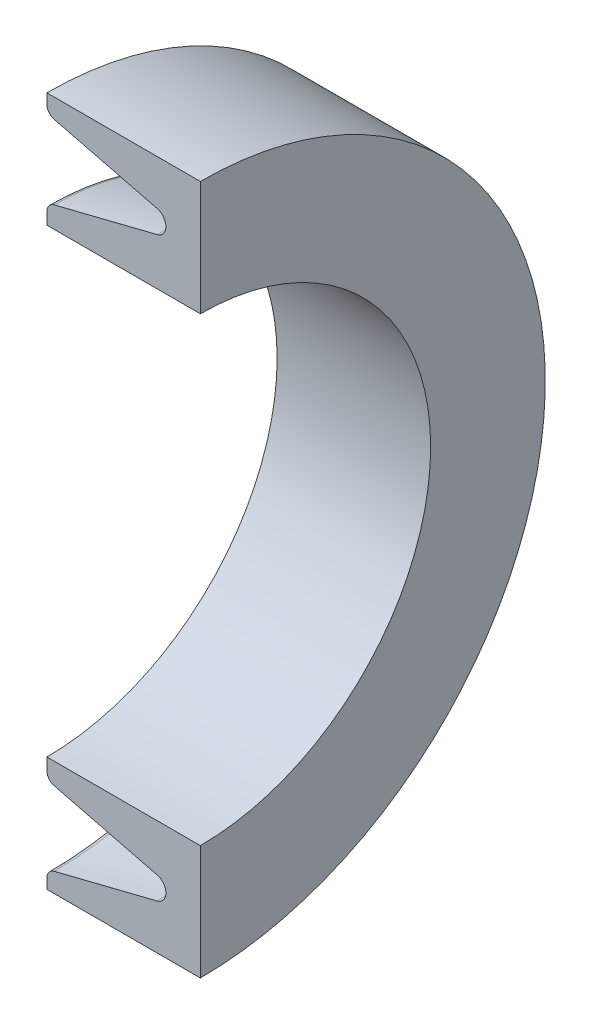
ISO-10303-21;
HEADER;
FILE_DESCRIPTION(('STEP AP214'),'2;1');
FILE_NAME('part.step','',(''),(''),'','','');
FILE_SCHEMA(('AUTOMOTIVE_DESIGN { 1 0 10303 214 1 1 1 1 }'));
ENDSEC;
DATA;
#1=APPLICATION_CONTEXT('core data for automotive mechanical design processes');
#2=APPLICATION_PROTOCOL_DEFINITION('international standard','automotive_design',2000,#1);
#3=PRODUCT_CONTEXT('',#1,'mechanical');
#4=PRODUCT('Part','Part','',(#3));
#5=PRODUCT_RELATED_PRODUCT_CATEGORY('part','',(#4));
#6=PRODUCT_DEFINITION_FORMATION('','',#4);
#7=PRODUCT_DEFINITION_CONTEXT('part definition',#1,'design');
#8=PRODUCT_DEFINITION('design','',#6,#7);
#9=PRODUCT_DEFINITION_SHAPE('','',#8);
#10=(LENGTH_UNIT() NAMED_UNIT(*) SI_UNIT(.MILLI.,.METRE.));
#11=(NAMED_UNIT(*) PLANE_ANGLE_UNIT() SI_UNIT($,.RADIAN.));
#12=(NAMED_UNIT(*) SI_UNIT($,.STERADIAN.) SOLID_ANGLE_UNIT());
#13=UNCERTAINTY_MEASURE_WITH_UNIT(LENGTH_MEASURE(1.E-05),#10,'distance_accuracy_value','');
#14=(GEOMETRIC_REPRESENTATION_CONTEXT(3) GLOBAL_UNCERTAINTY_ASSIGNED_CONTEXT((#13)) GLOBAL_UNIT_ASSIGNED_CONTEXT((#10,
#11,#12)) REPRESENTATION_CONTEXT('',''));
#15=CARTESIAN_POINT('',(0.,0.,0.));
#16=DIRECTION('',(0.,0.,1.));
#17=DIRECTION('',(1.,0.,0.));
#18=AXIS2_PLACEMENT_3D('',#15,#16,#17);
#19=CARTESIAN_POINT('',(-20.,40.,0.));
#20=DIRECTION('',(-1.,0.,0.));
#21=DIRECTION('',(0.,0.,1.));
#22=AXIS2_PLACEMENT_3D('',#19,#20,#21);
#23=PLANE('',#22);
#24=DIRECTION('',(0.,-1.,0.));
#25=VECTOR('',#24,1.);
#26=CARTESIAN_POINT('',(-20.,40.,0.));
#27=LINE('',#26,#25);
#28=CARTESIAN_POINT('',(-20.,64.3096117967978,0.));
#29=VERTEX_POINT('',#28);
#30=CARTESIAN_POINT('',(-20.,63.7,0.));
#31=VERTEX_POINT('',#30);
#32=EDGE_CURVE('E176',#29,#31,#27,.T.);
#33=ORIENTED_EDGE('',*,*,#32,.F.);
#34=CARTESIAN_POINT('',(-20.,51.85,0.));
#35=DIRECTION('',(-1.,0.,0.));
#36=DIRECTION('',(0.,0.,1.));
#37=AXIS2_PLACEMENT_3D('',#34,#35,#36);
#38=CIRCLE('',#37,12.4596117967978);
#39=CARTESIAN_POINT('',(-20.,39.3903882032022,0.));
#40=VERTEX_POINT('',#39);
#41=EDGE_CURVE('E138',#29,#40,#38,.T.);
#42=ORIENTED_EDGE('',*,*,#41,.T.);
#43=CARTESIAN_POINT('',(-20.,40.,0.));
#44=VERTEX_POINT('',#43);
#45=EDGE_CURVE('E46',#44,#40,#27,.T.);
#46=ORIENTED_EDGE('',*,*,#45,.F.);
#47=CARTESIAN_POINT('',(-20.,51.85,0.));
#48=DIRECTION('',(-1.,0.,0.));
#49=DIRECTION('',(0.,0.,1.));
#50=AXIS2_PLACEMENT_3D('',#47,#48,#49);
#51=CIRCLE('',#50,11.85);
#52=EDGE_CURVE('E124',#31,#44,#51,.T.);
#53=ORIENTED_EDGE('',*,*,#52,.F.);
#54=EDGE_LOOP('',(#33,#42,#46,#53));
#55=FACE_BOUND('',#54,.T.);
#56=ADVANCED_FACE('F24',(#55),#23,.T.);
#57=CARTESIAN_POINT('',(-28.0999999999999,51.85,0.));
#58=DIRECTION('',(-1.,0.,0.));
#59=DIRECTION('',(0.,0.,1.));
#60=AXIS2_PLACEMENT_3D('',#57,#58,#59);
#61=CYLINDRICAL_SURFACE('',#60,11.85);
#62=ORIENTED_EDGE('',*,*,#52,.T.);
#63=DIRECTION('',(-1.,0.,0.));
#64=VECTOR('',#63,1.);
#65=CARTESIAN_POINT('',(-28.0999999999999,40.,0.));
#66=LINE('',#65,#64);
#67=CARTESIAN_POINT('',(-12.1,40.,0.));
#68=VERTEX_POINT('',#67);
#69=EDGE_CURVE('E150',#44,#68,#66,.F.);
#70=ORIENTED_EDGE('',*,*,#69,.T.);
#71=CARTESIAN_POINT('',(-12.1,51.85,0.));
#72=DIRECTION('',(-1.,0.,0.));
#73=DIRECTION('',(0.,0.,1.));
#74=AXIS2_PLACEMENT_3D('',#71,#72,#73);
#75=CIRCLE('',#74,11.85);
#76=CARTESIAN_POINT('',(-12.1,63.7,0.));
#77=VERTEX_POINT('',#76);
#78=EDGE_CURVE('E116',#77,#68,#75,.T.);
#79=ORIENTED_EDGE('',*,*,#78,.F.);
#80=DIRECTION('',(-1.,0.,0.));
#81=VECTOR('',#80,1.);
#82=CARTESIAN_POINT('',(-28.0999999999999,63.7,0.));
#83=LINE('',#82,#81);
#84=EDGE_CURVE('E185',#77,#31,#83,.T.);
#85=ORIENTED_EDGE('',*,*,#84,.T.);
#86=EDGE_LOOP('',(#62,#70,#79,#85));
#87=FACE_BOUND('',#86,.T.);
#88=ADVANCED_FACE('F187',(#87),#61,.F.);
#89=CARTESIAN_POINT('',(-12.1,40.,0.));
#90=DIRECTION('',(-1.,0.,0.));
#91=DIRECTION('',(0.,0.,1.));
#92=AXIS2_PLACEMENT_3D('',#89,#90,#91);
#93=PLANE('',#92);
#94=CARTESIAN_POINT('',(-12.1,51.85,0.));
#95=DIRECTION('',(-1.,0.,0.));
#96=DIRECTION('',(0.,0.,1.));
#97=AXIS2_PLACEMENT_3D('',#94,#95,#96);
#98=CIRCLE('',#97,17.75);
#99=CARTESIAN_POINT('',(-12.1,69.6,0.));
#100=VERTEX_POINT('',#99);
#101=CARTESIAN_POINT('',(-12.1,34.1,0.));
#102=VERTEX_POINT('',#101);
#103=EDGE_CURVE('E114',#100,#102,#98,.T.);
#104=ORIENTED_EDGE('',*,*,#103,.F.);
#105=DIRECTION('',(0.,1.,0.));
#106=VECTOR('',#105,1.);
#107=CARTESIAN_POINT('',(-12.1,33.,0.));
#108=LINE('',#107,#106);
#109=EDGE_CURVE('E117',#77,#100,#108,.T.);
#110=ORIENTED_EDGE('',*,*,#109,.F.);
#111=ORIENTED_EDGE('',*,*,#78,.T.);
#112=EDGE_CURVE('E100',#102,#68,#108,.T.);
#113=ORIENTED_EDGE('',*,*,#112,.F.);
#114=EDGE_LOOP('',(#104,#110,#111,#113));
#115=FACE_BOUND('',#114,.T.);
#116=ADVANCED_FACE('F112',(#115),#93,.F.);
#117=CARTESIAN_POINT('',(-28.0999999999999,51.85,0.));
#118=DIRECTION('',(-1.,0.,0.));
#119=DIRECTION('',(0.,0.,1.));
#120=AXIS2_PLACEMENT_3D('',#117,#118,#119);
#121=CYLINDRICAL_SURFACE('',#120,17.75);
#122=DIRECTION('',(-1.,0.,0.));
#123=VECTOR('',#122,1.);
#124=CARTESIAN_POINT('',(-28.0999999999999,34.1,0.));
#125=LINE('',#124,#123);
#126=CARTESIAN_POINT('',(-20.,34.1,0.));
#127=VERTEX_POINT('',#126);
#128=EDGE_CURVE('E97',#127,#102,#125,.F.);
#129=ORIENTED_EDGE('',*,*,#128,.F.);
#130=CARTESIAN_POINT('',(-20.,51.85,0.));
#131=DIRECTION('',(-1.,0.,0.));
#132=DIRECTION('',(0.,0.,1.));
#133=AXIS2_PLACEMENT_3D('',#130,#131,#132);
#134=CIRCLE('',#133,17.75);
#135=CARTESIAN_POINT('',(-20.,69.6,0.));
#136=VERTEX_POINT('',#135);
#137=EDGE_CURVE('E122',#136,#127,#134,.T.);
#138=ORIENTED_EDGE('',*,*,#137,.F.);
#139=DIRECTION('',(-1.,0.,0.));
#140=VECTOR('',#139,1.);
#141=CARTESIAN_POINT('',(-28.0999999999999,69.6,0.));
#142=LINE('',#141,#140);
#143=EDGE_CURVE('E121',#100,#136,#142,.T.);
#144=ORIENTED_EDGE('',*,*,#143,.F.);
#145=ORIENTED_EDGE('',*,*,#103,.T.);
#146=EDGE_LOOP('',(#129,#138,#144,#145));
#147=FACE_BOUND('',#146,.T.);
#148=ADVANCED_FACE('F120',(#147),#121,.T.);
#149=CARTESIAN_POINT('',(-20.,34.1,0.));
#150=DIRECTION('',(1.,0.,0.));
#151=DIRECTION('',(0.,0.,-1.));
#152=AXIS2_PLACEMENT_3D('',#149,#150,#151);
#153=PLANE('',#152);
#154=ORIENTED_EDGE('',*,*,#137,.T.);
#155=DIRECTION('',(0.,1.,0.));
#156=VECTOR('',#155,1.);
#157=CARTESIAN_POINT('',(-20.,34.1,0.));
#158=LINE('',#157,#156);
#159=CARTESIAN_POINT('',(-20.,34.6096117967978,0.));
#160=VERTEX_POINT('',#159);
#161=EDGE_CURVE('E103',#127,#160,#158,.T.);
#162=ORIENTED_EDGE('',*,*,#161,.T.);
#163=CARTESIAN_POINT('',(-20.,51.85,0.));
#164=DIRECTION('',(-1.,0.,0.));
#165=DIRECTION('',(0.,0.,1.));
#166=AXIS2_PLACEMENT_3D('',#163,#164,#165);
#167=CIRCLE('',#166,17.2403882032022);
#168=CARTESIAN_POINT('',(-20.,69.0903882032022,0.));
#169=VERTEX_POINT('',#168);
#170=EDGE_CURVE('E126',#169,#160,#167,.T.);
#171=ORIENTED_EDGE('',*,*,#170,.F.);
#172=EDGE_CURVE('E170',#169,#136,#158,.T.);
#173=ORIENTED_EDGE('',*,*,#172,.T.);
#174=EDGE_LOOP('',(#154,#162,#171,#173));
#175=FACE_BOUND('',#174,.T.);
#176=ADVANCED_FACE('F169',(#175),#153,.F.);
#177=CARTESIAN_POINT('',(-19.5,51.85,0.));
#178=DIRECTION('',(-1.,0.,0.));
#179=DIRECTION('',(0.,0.,1.));
#180=AXIS2_PLACEMENT_3D('',#177,#178,#179);
#181=TOROIDAL_SURFACE('',#180,17.2403882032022,0.500000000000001);
#182=ORIENTED_EDGE('',*,*,#170,.T.);
#183=CARTESIAN_POINT('',(-19.5,34.6096117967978,0.));
#184=DIRECTION('',(0.,0.,-1.));
#185=DIRECTION('',(-1.,0.,0.));
#186=AXIS2_PLACEMENT_3D('',#183,#184,#185);
#187=CIRCLE('',#186,0.500000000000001);
#188=CARTESIAN_POINT('',(-19.6212678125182,35.0946830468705,0.));
#189=VERTEX_POINT('',#188);
#190=EDGE_CURVE('E165',#160,#189,#187,.T.);
#191=ORIENTED_EDGE('',*,*,#190,.T.);
#192=CARTESIAN_POINT('',(-19.6212678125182,51.85,0.));
#193=DIRECTION('',(-1.,0.,0.));
#194=DIRECTION('',(0.,0.,1.));
#195=AXIS2_PLACEMENT_3D('',#192,#193,#194);
#196=CIRCLE('',#195,16.7553169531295);
#197=CARTESIAN_POINT('',(-19.6212678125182,68.6053169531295,0.));
#198=VERTEX_POINT('',#197);
#199=EDGE_CURVE('E156',#198,#189,#196,.T.);
#200=ORIENTED_EDGE('',*,*,#199,.F.);
#201=CARTESIAN_POINT('',(-19.5,69.0903882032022,0.));
#202=DIRECTION('',(0.,0.,-1.));
#203=DIRECTION('',(-1.,0.,0.));
#204=AXIS2_PLACEMENT_3D('',#201,#202,#203);
#205=CIRCLE('',#204,0.500000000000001);
#206=EDGE_CURVE('E166',#198,#169,#205,.T.);
#207=ORIENTED_EDGE('',*,*,#206,.T.);
#208=EDGE_LOOP('',(#182,#191,#200,#207));
#209=FACE_BOUND('',#208,.T.);
#210=ADVANCED_FACE('F163',(#209),#181,.T.);
#211=CARTESIAN_POINT('',(-14.3283420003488,51.85,0.));
#212=DIRECTION('',(-1.,0.,0.));
#213=DIRECTION('',(0.,0.,1.));
#214=AXIS2_PLACEMENT_3D('',#211,#212,#213);
#215=CONICAL_SURFACE('',#214,15.4320855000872,0.244978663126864);
#216=DIRECTION('',(-0.970142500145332,-0.242535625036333,0.));
#217=VECTOR('',#216,1.);
#218=CARTESIAN_POINT('',(47.4,51.85,0.));
#219=LINE('',#218,#217);
#220=CARTESIAN_POINT('',(-14.3283420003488,36.4179144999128,0.));
#221=VERTEX_POINT('',#220);
#222=EDGE_CURVE('E172',#221,#189,#219,.T.);
#223=ORIENTED_EDGE('',*,*,#222,.F.);
#224=CARTESIAN_POINT('',(-14.3283420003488,51.85,0.));
#225=DIRECTION('',(-1.,0.,0.));
#226=DIRECTION('',(0.,0.,1.));
#227=AXIS2_PLACEMENT_3D('',#224,#225,#226);
#228=CIRCLE('',#227,15.4320855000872);
#229=CARTESIAN_POINT('',(-14.3283420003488,67.2820855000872,0.));
#230=VERTEX_POINT('',#229);
#231=EDGE_CURVE('E148',#230,#221,#228,.T.);
#232=ORIENTED_EDGE('',*,*,#231,.F.);
#233=DIRECTION('',(0.970142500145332,-0.242535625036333,0.));
#234=VECTOR('',#233,1.);
#235=CARTESIAN_POINT('',(47.4,51.85,0.));
#236=LINE('',#235,#234);
#237=EDGE_CURVE('E177',#198,#230,#236,.T.);
#238=ORIENTED_EDGE('',*,*,#237,.F.);
#239=ORIENTED_EDGE('',*,*,#199,.T.);
#240=EDGE_LOOP('',(#223,#232,#238,#239));
#241=FACE_BOUND('',#240,.T.);
#242=ADVANCED_FACE('F212',(#241),#215,.F.);
#243=CARTESIAN_POINT('',(-14.4738633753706,51.85,0.));
#244=DIRECTION('',(-1.,0.,0.));
#245=DIRECTION('',(0.,0.,1.));
#246=AXIS2_PLACEMENT_3D('',#243,#244,#245);
#247=TOROIDAL_SURFACE('',#246,14.85,0.600000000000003);
#248=ORIENTED_EDGE('',*,*,#231,.T.);
#249=CARTESIAN_POINT('',(-14.4738633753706,37.,0.));
#250=DIRECTION('',(0.,0.,-1.));
#251=DIRECTION('',(-1.,0.,0.));
#252=AXIS2_PLACEMENT_3D('',#249,#250,#251);
#253=CIRCLE('',#252,0.600000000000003);
#254=CARTESIAN_POINT('',(-14.3283420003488,37.5820855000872,0.));
#255=VERTEX_POINT('',#254);
#256=EDGE_CURVE('E192',#221,#255,#253,.F.);
#257=ORIENTED_EDGE('',*,*,#256,.T.);
#258=CARTESIAN_POINT('',(-14.3283420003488,51.85,0.));
#259=DIRECTION('',(-1.,0.,0.));
#260=DIRECTION('',(0.,0.,1.));
#261=AXIS2_PLACEMENT_3D('',#258,#259,#260);
#262=CIRCLE('',#261,14.2679144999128);
#263=CARTESIAN_POINT('',(-14.3283420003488,66.1179144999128,0.));
#264=VERTEX_POINT('',#263);
#265=EDGE_CURVE('E146',#264,#255,#262,.T.);
#266=ORIENTED_EDGE('',*,*,#265,.F.);
#267=CARTESIAN_POINT('',(-14.4738633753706,66.7,0.));
#268=DIRECTION('',(0.,0.,-1.));
#269=DIRECTION('',(-1.,0.,0.));
#270=AXIS2_PLACEMENT_3D('',#267,#268,#269);
#271=CIRCLE('',#270,0.600000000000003);
#272=EDGE_CURVE('E178',#264,#230,#271,.F.);
#273=ORIENTED_EDGE('',*,*,#272,.T.);
#274=EDGE_LOOP('',(#248,#257,#266,#273));
#275=FACE_BOUND('',#274,.T.);
#276=ADVANCED_FACE('F215',(#275),#247,.F.);
#277=CARTESIAN_POINT('',(-19.6212678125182,51.85,0.));
#278=DIRECTION('',(1.,0.,0.));
#279=DIRECTION('',(0.,0.,-1.));
#280=AXIS2_PLACEMENT_3D('',#277,#278,#279);
#281=CONICAL_SURFACE('',#280,12.9446830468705,0.244978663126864);
#282=DIRECTION('',(0.970142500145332,0.242535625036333,0.));
#283=VECTOR('',#282,1.);
#284=CARTESIAN_POINT('',(-71.4,51.85,0.));
#285=LINE('',#284,#283);
#286=CARTESIAN_POINT('',(-19.6212678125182,64.7946830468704,0.));
#287=VERTEX_POINT('',#286);
#288=EDGE_CURVE('E38',#264,#287,#285,.F.);
#289=ORIENTED_EDGE('',*,*,#288,.F.);
#290=ORIENTED_EDGE('',*,*,#265,.T.);
#291=DIRECTION('',(-0.970142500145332,0.242535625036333,0.));
#292=VECTOR('',#291,1.);
#293=CARTESIAN_POINT('',(-71.4,51.85,0.));
#294=LINE('',#293,#292);
#295=CARTESIAN_POINT('',(-19.6212678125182,38.9053169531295,0.));
#296=VERTEX_POINT('',#295);
#297=EDGE_CURVE('E145',#296,#255,#294,.F.);
#298=ORIENTED_EDGE('',*,*,#297,.F.);
#299=CARTESIAN_POINT('',(-19.6212678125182,51.85,0.));
#300=DIRECTION('',(-1.,0.,0.));
#301=DIRECTION('',(0.,0.,1.));
#302=AXIS2_PLACEMENT_3D('',#299,#300,#301);
#303=CIRCLE('',#302,12.9446830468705);
#304=EDGE_CURVE('E136',#287,#296,#303,.T.);
#305=ORIENTED_EDGE('',*,*,#304,.F.);
#306=EDGE_LOOP('',(#289,#290,#298,#305));
#307=FACE_BOUND('',#306,.T.);
#308=ADVANCED_FACE('F142',(#307),#281,.T.);
#309=CARTESIAN_POINT('',(-19.5,51.85,0.));
#310=DIRECTION('',(-1.,0.,0.));
#311=DIRECTION('',(0.,0.,1.));
#312=AXIS2_PLACEMENT_3D('',#309,#310,#311);
#313=TOROIDAL_SURFACE('',#312,12.4596117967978,0.500000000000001);
#314=ORIENTED_EDGE('',*,*,#304,.T.);
#315=CARTESIAN_POINT('',(-19.5,39.3903882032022,0.));
#316=DIRECTION('',(0.,0.,-1.));
#317=DIRECTION('',(-1.,0.,0.));
#318=AXIS2_PLACEMENT_3D('',#315,#316,#317);
#319=CIRCLE('',#318,0.500000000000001);
#320=EDGE_CURVE('E11',#296,#40,#319,.T.);
#321=ORIENTED_EDGE('',*,*,#320,.T.);
#322=ORIENTED_EDGE('',*,*,#41,.F.);
#323=CARTESIAN_POINT('',(-19.5,64.3096117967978,0.));
#324=DIRECTION('',(0.,0.,-1.));
#325=DIRECTION('',(-1.,0.,0.));
#326=AXIS2_PLACEMENT_3D('',#323,#324,#325);
#327=CIRCLE('',#326,0.500000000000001);
#328=EDGE_CURVE('E31',#29,#287,#327,.T.);
#329=ORIENTED_EDGE('',*,*,#328,.T.);
#330=EDGE_LOOP('',(#314,#321,#322,#329));
#331=FACE_BOUND('',#330,.T.);
#332=ADVANCED_FACE('F135',(#331),#313,.T.);
#333=CARTESIAN_POINT('',(-62.1,33.,0.));
#334=DIRECTION('',(0.,0.,-1.));
#335=DIRECTION('',(-1.,0.,0.));
#336=AXIS2_PLACEMENT_3D('',#333,#334,#335);
#337=PLANE('',#336);
#338=ORIENTED_EDGE('',*,*,#109,.T.);
#339=ORIENTED_EDGE('',*,*,#143,.T.);
#340=ORIENTED_EDGE('',*,*,#172,.F.);
#341=ORIENTED_EDGE('',*,*,#206,.F.);
#342=ORIENTED_EDGE('',*,*,#237,.T.);
#343=ORIENTED_EDGE('',*,*,#272,.F.);
#344=ORIENTED_EDGE('',*,*,#288,.T.);
#345=ORIENTED_EDGE('',*,*,#328,.F.);
#346=ORIENTED_EDGE('',*,*,#32,.T.);
#347=ORIENTED_EDGE('',*,*,#84,.F.);
#348=EDGE_LOOP('',(#338,#339,#340,#341,#342,#343,#344,#345,#346,#347));
#349=FACE_BOUND('',#348,.T.);
#350=ADVANCED_FACE('F183',(#349),#337,.F.);
#351=ORIENTED_EDGE('',*,*,#45,.T.);
#352=ORIENTED_EDGE('',*,*,#320,.F.);
#353=ORIENTED_EDGE('',*,*,#297,.T.);
#354=ORIENTED_EDGE('',*,*,#256,.F.);
#355=ORIENTED_EDGE('',*,*,#222,.T.);
#356=ORIENTED_EDGE('',*,*,#190,.F.);
#357=ORIENTED_EDGE('',*,*,#161,.F.);
#358=ORIENTED_EDGE('',*,*,#128,.T.);
#359=ORIENTED_EDGE('',*,*,#112,.T.);
#360=ORIENTED_EDGE('',*,*,#69,.F.);
#361=EDGE_LOOP('',(#351,#352,#353,#354,#355,#356,#357,#358,#359,#360));
#362=FACE_BOUND('',#361,.T.);
#363=ADVANCED_FACE('F99',(#362),#337,.F.);
#364=CLOSED_SHELL('',(#56,#88,#116,#148,#176,#210,#242,#276,#308,#332,#350,#363));
#365=MANIFOLD_SOLID_BREP('B2',#364);
#366=ADVANCED_BREP_SHAPE_REPRESENTATION('',(#18,#365),#14);
#367=SHAPE_DEFINITION_REPRESENTATION(#9,#366);
ENDSEC;
END-ISO-10303-21;
